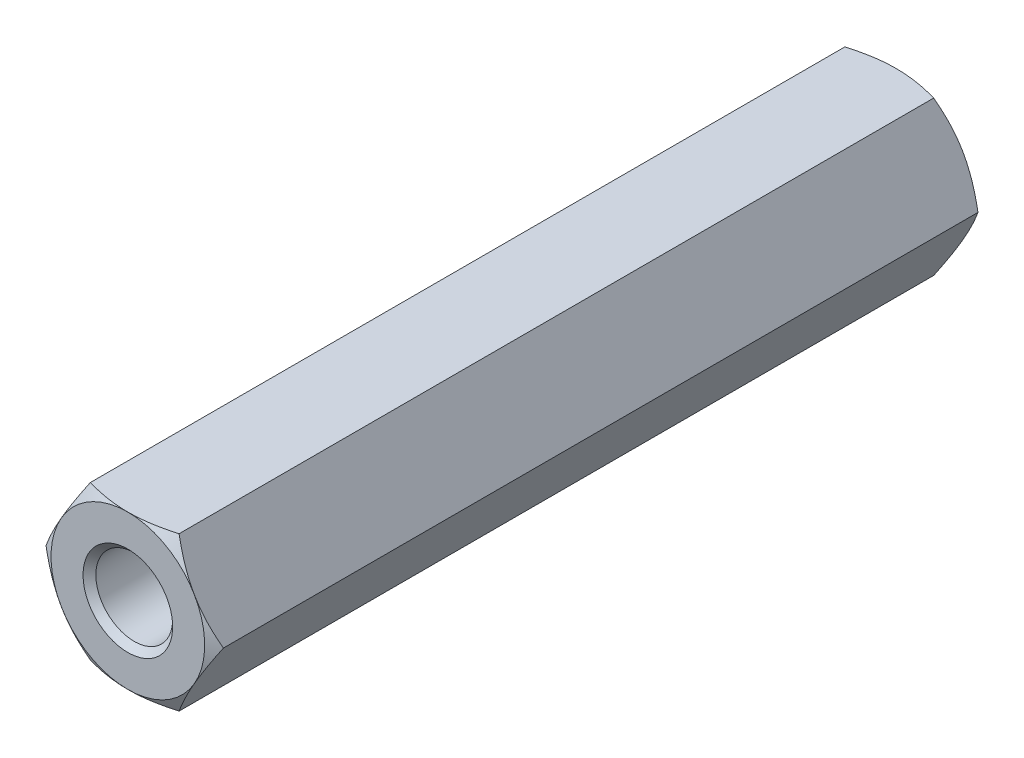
ISO-10303-21;
HEADER;
FILE_DESCRIPTION(('STEP AP214'),'2;1');
FILE_NAME('part.step','',(''),(''),'','','');
FILE_SCHEMA(('AUTOMOTIVE_DESIGN { 1 0 10303 214 1 1 1 1 }'));
ENDSEC;
DATA;
#1=APPLICATION_CONTEXT('core data for automotive mechanical design processes');
#2=APPLICATION_PROTOCOL_DEFINITION('international standard','automotive_design',2000,#1);
#3=PRODUCT_CONTEXT('',#1,'mechanical');
#4=PRODUCT('Part','Part','',(#3));
#5=PRODUCT_RELATED_PRODUCT_CATEGORY('part','',(#4));
#6=PRODUCT_DEFINITION_FORMATION('','',#4);
#7=PRODUCT_DEFINITION_CONTEXT('part definition',#1,'design');
#8=PRODUCT_DEFINITION('design','',#6,#7);
#9=PRODUCT_DEFINITION_SHAPE('','',#8);
#10=(LENGTH_UNIT() NAMED_UNIT(*) SI_UNIT(.MILLI.,.METRE.));
#11=(NAMED_UNIT(*) PLANE_ANGLE_UNIT() SI_UNIT($,.RADIAN.));
#12=(NAMED_UNIT(*) SI_UNIT($,.STERADIAN.) SOLID_ANGLE_UNIT());
#13=UNCERTAINTY_MEASURE_WITH_UNIT(LENGTH_MEASURE(1.E-05),#10,'distance_accuracy_value','');
#14=(GEOMETRIC_REPRESENTATION_CONTEXT(3) GLOBAL_UNCERTAINTY_ASSIGNED_CONTEXT((#13)) GLOBAL_UNIT_ASSIGNED_CONTEXT((#10,
#11,#12)) REPRESENTATION_CONTEXT('',''));
#15=CARTESIAN_POINT('',(0.,0.,0.));
#16=DIRECTION('',(0.,0.,1.));
#17=DIRECTION('',(1.,0.,0.));
#18=AXIS2_PLACEMENT_3D('',#15,#16,#17);
#19=CARTESIAN_POINT('',(3.46410161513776,0.,-15.));
#20=DIRECTION('',(0.866025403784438,0.5,0.));
#21=DIRECTION('',(-0.5,0.866025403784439,0.));
#22=AXIS2_PLACEMENT_3D('',#19,#20,#21);
#23=PLANE('',#22);
#24=CARTESIAN_POINT('',(3.46421708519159,-0.000199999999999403,14.731984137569));
#25=CARTESIAN_POINT('',(3.38810199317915,0.131635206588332,14.7759462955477));
#26=CARTESIAN_POINT('',(3.31132988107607,0.26460840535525,14.8159284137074));
#27=CARTESIAN_POINT('',(3.15645624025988,0.532857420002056,14.8857179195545));
#28=CARTESIAN_POINT('',(3.078351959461,0.668138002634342,14.9155006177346));
#29=CARTESIAN_POINT('',(2.92311136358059,0.937022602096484,14.9618621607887));
#30=CARTESIAN_POINT('',(2.84599893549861,1.07058524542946,14.978749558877));
#31=CARTESIAN_POINT('',(2.6914112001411,1.33833905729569,14.9989103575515));
#32=CARTESIAN_POINT('',(2.61393645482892,1.47252925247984,15.0022004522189));
#33=CARTESIAN_POINT('',(2.46916798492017,1.72327559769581,14.9953594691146));
#34=CARTESIAN_POINT('',(2.40185259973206,1.83986926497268,14.9869080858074));
#35=CARTESIAN_POINT('',(2.2676603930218,2.07229698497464,14.960121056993));
#36=CARTESIAN_POINT('',(2.2007840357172,2.18813023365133,14.9417762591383));
#37=CARTESIAN_POINT('',(2.06631510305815,2.42103725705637,14.8959152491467));
#38=CARTESIAN_POINT('',(1.99873954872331,2.53808155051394,14.8682046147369));
#39=CARTESIAN_POINT('',(1.86459637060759,2.77042435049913,14.8053122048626));
#40=CARTESIAN_POINT('',(1.79802702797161,2.88572583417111,14.7701452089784));
#41=CARTESIAN_POINT('',(1.73193533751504,3.0002,14.731984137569));
#42=B_SPLINE_CURVE_WITH_KNOTS('',3,(#24,#25,#26,#27,#28,#29,#30,#31,#32,#33,#34,#35,#36,#37,#38,
#39,#40,#41),.UNSPECIFIED.,.F.,.F.,(4,2,2,2,2,2,2,2,4),(0.,0.475539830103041,0.952222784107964,
1.41710776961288,1.88142182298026,2.28572436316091,2.69040156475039,3.10405572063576,
3.5168974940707),.UNSPECIFIED.);
#43=CARTESIAN_POINT('',(3.46410161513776,0.,14.7320508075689));
#44=VERTEX_POINT('',#43);
#45=CARTESIAN_POINT('',(2.59807621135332,1.5,15.));
#46=VERTEX_POINT('',#45);
#47=EDGE_CURVE('E171',#44,#46,#42,.T.);
#48=ORIENTED_EDGE('',*,*,#47,.F.);
#49=DIRECTION('',(0.,0.,1.));
#50=VECTOR('',#49,1.);
#51=CARTESIAN_POINT('',(3.46410161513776,0.,-15.));
#52=LINE('',#51,#50);
#53=CARTESIAN_POINT('',(3.46410161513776,0.,-14.7320508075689));
#54=VERTEX_POINT('',#53);
#55=EDGE_CURVE('E320',#54,#44,#52,.T.);
#56=ORIENTED_EDGE('',*,*,#55,.F.);
#57=CARTESIAN_POINT('',(3.46421708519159,-0.000199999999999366,-14.731984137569));
#58=CARTESIAN_POINT('',(3.38810199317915,0.131635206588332,-14.7759462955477));
#59=CARTESIAN_POINT('',(3.31132988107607,0.26460840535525,-14.8159284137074));
#60=CARTESIAN_POINT('',(3.15645624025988,0.532857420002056,-14.8857179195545));
#61=CARTESIAN_POINT('',(3.078351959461,0.668138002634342,-14.9155006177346));
#62=CARTESIAN_POINT('',(2.92311136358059,0.937022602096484,-14.9618621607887));
#63=CARTESIAN_POINT('',(2.84599893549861,1.07058524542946,-14.978749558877));
#64=CARTESIAN_POINT('',(2.6914112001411,1.33833905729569,-14.9989103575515));
#65=CARTESIAN_POINT('',(2.61393645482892,1.47252925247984,-15.0022004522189));
#66=CARTESIAN_POINT('',(2.46916798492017,1.72327559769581,-14.9953594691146));
#67=CARTESIAN_POINT('',(2.40185259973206,1.83986926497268,-14.9869080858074));
#68=CARTESIAN_POINT('',(2.2676603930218,2.07229698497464,-14.960121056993));
#69=CARTESIAN_POINT('',(2.2007840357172,2.18813023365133,-14.9417762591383));
#70=CARTESIAN_POINT('',(2.06631510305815,2.42103725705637,-14.8959152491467));
#71=CARTESIAN_POINT('',(1.99873954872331,2.53808155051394,-14.8682046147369));
#72=CARTESIAN_POINT('',(1.86459637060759,2.77042435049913,-14.8053122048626));
#73=CARTESIAN_POINT('',(1.79802702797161,2.88572583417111,-14.7701452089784));
#74=CARTESIAN_POINT('',(1.73193533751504,3.0002,-14.731984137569));
#75=B_SPLINE_CURVE_WITH_KNOTS('',3,(#57,#58,#59,#60,#61,#62,#63,#64,#65,#66,#67,#68,#69,#70,#71,
#72,#73,#74),.UNSPECIFIED.,.F.,.F.,(4,2,2,2,2,2,2,2,4),(0.,0.475539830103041,0.952222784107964,
1.41710776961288,1.88142182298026,2.28572436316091,2.69040156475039,3.10405572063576,
3.5168974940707),.UNSPECIFIED.);
#76=CARTESIAN_POINT('',(2.59807621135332,1.5,-15.));
#77=VERTEX_POINT('',#76);
#78=EDGE_CURVE('E305',#54,#77,#75,.T.);
#79=ORIENTED_EDGE('',*,*,#78,.T.);
#80=CARTESIAN_POINT('',(1.73205080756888,3.,-14.7320508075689));
#81=VERTEX_POINT('',#80);
#82=EDGE_CURVE('E252',#77,#81,#75,.T.);
#83=ORIENTED_EDGE('',*,*,#82,.T.);
#84=DIRECTION('',(0.,0.,1.));
#85=VECTOR('',#84,1.);
#86=CARTESIAN_POINT('',(1.73205080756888,3.,-15.));
#87=LINE('',#86,#85);
#88=CARTESIAN_POINT('',(1.73205080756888,3.,14.7320508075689));
#89=VERTEX_POINT('',#88);
#90=EDGE_CURVE('E352',#81,#89,#87,.T.);
#91=ORIENTED_EDGE('',*,*,#90,.T.);
#92=EDGE_CURVE('E147',#46,#89,#42,.T.);
#93=ORIENTED_EDGE('',*,*,#92,.F.);
#94=EDGE_LOOP('',(#48,#56,#79,#83,#91,#93));
#95=FACE_BOUND('',#94,.T.);
#96=ADVANCED_FACE('F41',(#95),#23,.T.);
#97=CARTESIAN_POINT('',(1.73205080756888,-3.,-15.));
#98=DIRECTION('',(0.866025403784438,-0.5,0.));
#99=DIRECTION('',(0.5,0.866025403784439,0.));
#100=AXIS2_PLACEMENT_3D('',#97,#98,#99);
#101=PLANE('',#100);
#102=CARTESIAN_POINT('',(1.73193533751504,-3.0002,14.731984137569));
#103=CARTESIAN_POINT('',(1.80805042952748,-2.86836479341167,14.7759462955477));
#104=CARTESIAN_POINT('',(1.88482254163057,-2.73539159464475,14.8159284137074));
#105=CARTESIAN_POINT('',(2.03969618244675,-2.46714257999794,14.8857179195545));
#106=CARTESIAN_POINT('',(2.11780046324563,-2.33186199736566,14.9155006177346));
#107=CARTESIAN_POINT('',(2.27304105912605,-2.06297739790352,14.9618621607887));
#108=CARTESIAN_POINT('',(2.35015348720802,-1.92941475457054,14.9787495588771));
#109=CARTESIAN_POINT('',(2.50474122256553,-1.66166094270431,14.9989103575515));
#110=CARTESIAN_POINT('',(2.58221596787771,-1.52747074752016,15.0022004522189));
#111=CARTESIAN_POINT('',(2.72698443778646,-1.27672440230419,14.9953594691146));
#112=CARTESIAN_POINT('',(2.79429982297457,-1.16013073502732,14.9869080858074));
#113=CARTESIAN_POINT('',(2.92849202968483,-0.927703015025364,14.960121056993));
#114=CARTESIAN_POINT('',(2.99536838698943,-0.81186976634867,14.9417762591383));
#115=CARTESIAN_POINT('',(3.12983731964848,-0.578962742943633,14.8959152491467));
#116=CARTESIAN_POINT('',(3.19741287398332,-0.46191844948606,14.8682046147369));
#117=CARTESIAN_POINT('',(3.33155605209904,-0.229575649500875,14.8053122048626));
#118=CARTESIAN_POINT('',(3.39812539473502,-0.114274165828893,14.7701452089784));
#119=CARTESIAN_POINT('',(3.46421708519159,0.000200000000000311,14.731984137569));
#120=B_SPLINE_CURVE_WITH_KNOTS('',3,(#102,#103,#104,#105,#106,#107,#108,#109,#110,#111,#112,
#113,#114,#115,#116,#117,#118,#119),.UNSPECIFIED.,.F.,.F.,(4,2,2,2,2,2,2,2,4),(0.,
0.47553983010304,0.952222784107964,1.41710776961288,1.88142182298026,2.28572436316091,
2.69040156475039,3.10405572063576,3.5168974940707),.UNSPECIFIED.);
#121=CARTESIAN_POINT('',(1.73205080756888,-3.,14.7320508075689));
#122=VERTEX_POINT('',#121);
#123=CARTESIAN_POINT('',(2.59807621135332,-1.5,15.));
#124=VERTEX_POINT('',#123);
#125=EDGE_CURVE('E421',#122,#124,#120,.T.);
#126=ORIENTED_EDGE('',*,*,#125,.F.);
#127=DIRECTION('',(0.,0.,1.));
#128=VECTOR('',#127,1.);
#129=CARTESIAN_POINT('',(1.73205080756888,-3.,-15.));
#130=LINE('',#129,#128);
#131=CARTESIAN_POINT('',(1.73205080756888,-3.,-14.7320508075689));
#132=VERTEX_POINT('',#131);
#133=EDGE_CURVE('E424',#132,#122,#130,.T.);
#134=ORIENTED_EDGE('',*,*,#133,.F.);
#135=CARTESIAN_POINT('',(1.73193533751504,-3.0002,-14.731984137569));
#136=CARTESIAN_POINT('',(1.80805042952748,-2.86836479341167,-14.7759462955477));
#137=CARTESIAN_POINT('',(1.88482254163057,-2.73539159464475,-14.8159284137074));
#138=CARTESIAN_POINT('',(2.03969618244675,-2.46714257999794,-14.8857179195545));
#139=CARTESIAN_POINT('',(2.11780046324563,-2.33186199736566,-14.9155006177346));
#140=CARTESIAN_POINT('',(2.27304105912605,-2.06297739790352,-14.9618621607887));
#141=CARTESIAN_POINT('',(2.35015348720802,-1.92941475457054,-14.9787495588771));
#142=CARTESIAN_POINT('',(2.50474122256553,-1.66166094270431,-14.9989103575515));
#143=CARTESIAN_POINT('',(2.58221596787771,-1.52747074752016,-15.0022004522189));
#144=CARTESIAN_POINT('',(2.72698443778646,-1.27672440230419,-14.9953594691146));
#145=CARTESIAN_POINT('',(2.79429982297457,-1.16013073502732,-14.9869080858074));
#146=CARTESIAN_POINT('',(2.92849202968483,-0.927703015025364,-14.960121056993));
#147=CARTESIAN_POINT('',(2.99536838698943,-0.81186976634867,-14.9417762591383));
#148=CARTESIAN_POINT('',(3.12983731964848,-0.578962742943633,-14.8959152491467));
#149=CARTESIAN_POINT('',(3.19741287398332,-0.46191844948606,-14.8682046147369));
#150=CARTESIAN_POINT('',(3.33155605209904,-0.229575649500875,-14.8053122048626));
#151=CARTESIAN_POINT('',(3.39812539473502,-0.114274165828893,-14.7701452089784));
#152=CARTESIAN_POINT('',(3.46421708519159,0.000200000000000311,-14.731984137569));
#153=B_SPLINE_CURVE_WITH_KNOTS('',3,(#135,#136,#137,#138,#139,#140,#141,#142,#143,#144,#145,
#146,#147,#148,#149,#150,#151,#152),.UNSPECIFIED.,.F.,.F.,(4,2,2,2,2,2,2,2,4),(0.,
0.47553983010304,0.952222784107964,1.41710776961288,1.88142182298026,2.28572436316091,
2.69040156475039,3.10405572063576,3.5168974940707),.UNSPECIFIED.);
#154=CARTESIAN_POINT('',(2.59807621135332,-1.5,-15.));
#155=VERTEX_POINT('',#154);
#156=EDGE_CURVE('E335',#132,#155,#153,.T.);
#157=ORIENTED_EDGE('',*,*,#156,.T.);
#158=EDGE_CURVE('E249',#155,#54,#153,.T.);
#159=ORIENTED_EDGE('',*,*,#158,.T.);
#160=ORIENTED_EDGE('',*,*,#55,.T.);
#161=EDGE_CURVE('E175',#124,#44,#120,.T.);
#162=ORIENTED_EDGE('',*,*,#161,.F.);
#163=EDGE_LOOP('',(#126,#134,#157,#159,#160,#162));
#164=FACE_BOUND('',#163,.T.);
#165=ADVANCED_FACE('F332',(#164),#101,.T.);
#166=CARTESIAN_POINT('',(-1.73205080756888,-3.,-15.));
#167=DIRECTION('',(0.,-1.,0.));
#168=DIRECTION('',(0.,0.,-1.));
#169=AXIS2_PLACEMENT_3D('',#166,#167,#168);
#170=PLANE('',#169);
#171=CARTESIAN_POINT('',(-23.5121203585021,-3.,3.04726845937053));
#172=CARTESIAN_POINT('',(-23.0125016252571,-3.,3.33340131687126));
#173=CARTESIAN_POINT('',(-22.5128220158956,-3.,3.61942793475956));
#174=CARTESIAN_POINT('',(-21.5133088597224,-3.,4.19121257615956));
#175=CARTESIAN_POINT('',(-21.0134753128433,-3.,4.47697059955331));
#176=CARTESIAN_POINT('',(-19.5136614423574,-3.,5.33377705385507));
#177=CARTESIAN_POINT('',(-18.5134025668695,-3.,5.90433799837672));
#178=CARTESIAN_POINT('',(-16.5093485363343,-3.,7.04478460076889));
#179=CARTESIAN_POINT('',(-15.505550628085,-3.,7.61466542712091));
#180=CARTESIAN_POINT('',(-13.9983454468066,-3.,8.46679124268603));
#181=CARTESIAN_POINT('',(-13.4956984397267,-3.,8.75038052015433));
#182=CARTESIAN_POINT('',(-12.489700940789,-3.,9.31630809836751));
#183=CARTESIAN_POINT('',(-11.9863504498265,-3.,9.59864640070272));
#184=CARTESIAN_POINT('',(-10.978614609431,-3.,10.1615674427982));
#185=CARTESIAN_POINT('',(-10.4742291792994,-3.,10.4421500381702));
#186=CARTESIAN_POINT('',(-9.46397256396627,-3.,11.0006941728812));
#187=CARTESIAN_POINT('',(-8.9581013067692,-3.,11.2786555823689));
#188=CARTESIAN_POINT('',(-8.19786328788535,-3.,11.6922788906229));
#189=CARTESIAN_POINT('',(-7.94435759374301,-3.,11.8295225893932));
#190=CARTESIAN_POINT('',(-7.43660558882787,-3.,12.1026322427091));
#191=CARTESIAN_POINT('',(-7.18235928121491,-3.,12.2384982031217));
#192=CARTESIAN_POINT('',(-6.67292612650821,-3.,12.5083994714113));
#193=CARTESIAN_POINT('',(-6.41773937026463,-3.,12.6424349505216));
#194=CARTESIAN_POINT('',(-5.90608526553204,-3.,12.9080359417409));
#195=CARTESIAN_POINT('',(-5.64961793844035,-3.,13.0396014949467));
#196=CARTESIAN_POINT('',(-5.13550344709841,-3.,13.2989862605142));
#197=CARTESIAN_POINT('',(-4.87786014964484,-3.,13.4268131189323));
#198=CARTESIAN_POINT('',(-4.36009697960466,-3.,13.6775229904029));
#199=CARTESIAN_POINT('',(-4.09997665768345,-3.,13.8004050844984));
#200=CARTESIAN_POINT('',(-3.70668295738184,-3.,13.9792931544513));
#201=CARTESIAN_POINT('',(-3.57479856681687,-3.,14.0381291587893));
#202=CARTESIAN_POINT('',(-3.30998465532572,-3.,14.1533943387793));
#203=CARTESIAN_POINT('',(-3.17705517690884,-3.,14.209823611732));
#204=CARTESIAN_POINT('',(-2.90996739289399,-3.,14.3196438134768));
#205=CARTESIAN_POINT('',(-2.77580930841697,-3.,14.3730352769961));
#206=CARTESIAN_POINT('',(-2.50602641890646,-3.,14.4759538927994));
#207=CARTESIAN_POINT('',(-2.3704017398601,-3.,14.5254813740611));
#208=CARTESIAN_POINT('',(-2.0616346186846,-3.,14.6319545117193));
#209=CARTESIAN_POINT('',(-1.88797956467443,-3.,14.6874399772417));
#210=CARTESIAN_POINT('',(-1.53756772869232,-3.,14.7877447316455));
#211=CARTESIAN_POINT('',(-1.36081106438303,-3.,14.8325644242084));
#212=CARTESIAN_POINT('',(-1.00613235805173,-3.,14.907631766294));
#213=CARTESIAN_POINT('',(-0.828244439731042,-3.,14.9380340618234));
#214=CARTESIAN_POINT('',(-0.55989242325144,-3.,14.9708201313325));
#215=CARTESIAN_POINT('',(-0.470192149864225,-3.,14.9796124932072));
#216=CARTESIAN_POINT('',(-0.290467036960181,-3.,14.9926604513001));
#217=CARTESIAN_POINT('',(-0.200442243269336,-3.,14.9969166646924));
#218=CARTESIAN_POINT('',(-0.0194561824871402,-3.,15.0007576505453));
#219=CARTESIAN_POINT('',(0.071506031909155,-3.,15.0002987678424));
#220=CARTESIAN_POINT('',(0.25327359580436,-3.,14.9946299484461));
#221=CARTESIAN_POINT('',(0.344078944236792,-3.,14.9894199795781));
#222=CARTESIAN_POINT('',(0.615961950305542,-3.,14.9668925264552));
#223=CARTESIAN_POINT('',(0.796507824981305,-3.,14.9426775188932));
#224=CARTESIAN_POINT('',(1.06617280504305,-3.,14.8945500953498));
#225=CARTESIAN_POINT('',(1.15640234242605,-3.,14.8763960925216));
#226=CARTESIAN_POINT('',(1.3360958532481,-3.,14.8365924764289));
#227=CARTESIAN_POINT('',(1.42555981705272,-3.,14.814942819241));
#228=CARTESIAN_POINT('',(1.60369363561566,-3.,14.768592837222));
#229=CARTESIAN_POINT('',(1.69236342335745,-3.,14.7438922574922));
#230=CARTESIAN_POINT('',(1.86891903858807,-3.,14.6918626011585));
#231=CARTESIAN_POINT('',(1.95680490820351,-3.,14.6645336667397));
#232=CARTESIAN_POINT('',(2.21653910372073,-3.,14.5800952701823));
#233=CARTESIAN_POINT('',(2.38733895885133,-3.,14.5197588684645));
#234=CARTESIAN_POINT('',(2.72656600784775,-3.,14.3927121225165));
#235=CARTESIAN_POINT('',(2.89499251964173,-3.,14.3259999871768));
#236=CARTESIAN_POINT('',(3.23005689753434,-3.,14.1878076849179));
#237=CARTESIAN_POINT('',(3.39669288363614,-3.,14.1163229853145));
#238=CARTESIAN_POINT('',(3.72838320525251,-3.,13.9698388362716));
#239=CARTESIAN_POINT('',(3.89343770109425,-3.,13.8948397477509));
#240=CARTESIAN_POINT('',(4.22275500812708,-3.,13.7419530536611));
#241=CARTESIAN_POINT('',(4.38701436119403,-3.,13.6640580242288));
#242=CARTESIAN_POINT('',(4.71452905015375,-3.,13.5061817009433));
#243=CARTESIAN_POINT('',(4.87778436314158,-3.,13.426200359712));
#244=CARTESIAN_POINT('',(5.36616370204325,-3.,13.1839158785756));
#245=CARTESIAN_POINT('',(5.69008278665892,-3.,13.019186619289));
#246=CARTESIAN_POINT('',(6.33711013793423,-3.,12.6849027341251));
#247=CARTESIAN_POINT('',(6.66020946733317,-3.,12.5153309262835));
#248=CARTESIAN_POINT('',(7.30493962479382,-3.,12.1733240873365));
#249=CARTESIAN_POINT('',(7.62657026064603,-3.,12.0008886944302));
#250=CARTESIAN_POINT('',(8.26818113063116,-3.,11.654320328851));
#251=CARTESIAN_POINT('',(8.58816327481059,-3.,11.4801908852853));
#252=CARTESIAN_POINT('',(9.22732690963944,-3.,11.1304674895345));
#253=CARTESIAN_POINT('',(9.54650839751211,-3.,10.9548735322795));
#254=CARTESIAN_POINT('',(10.442065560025,-3.,10.4601995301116));
#255=CARTESIAN_POINT('',(11.0177581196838,-3.,10.1398834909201));
#256=CARTESIAN_POINT('',(12.167901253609,-3.,9.49701304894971));
#257=CARTESIAN_POINT('',(12.7423518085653,-3.,9.17445861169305));
#258=CARTESIAN_POINT('',(13.8907915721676,-3.,8.52761768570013));
#259=CARTESIAN_POINT('',(14.4647802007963,-3.,8.20333016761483));
#260=CARTESIAN_POINT('',(15.6121551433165,-3.,7.55369151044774));
#261=CARTESIAN_POINT('',(16.1855414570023,-3.,7.22834037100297));
#262=CARTESIAN_POINT('',(17.3223106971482,-3.,6.58229545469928));
#263=CARTESIAN_POINT('',(17.8857009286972,-3.,6.26161452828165));
#264=CARTESIAN_POINT('',(19.0121589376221,-3.,5.61968480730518));
#265=CARTESIAN_POINT('',(19.5752267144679,-3.,5.29843601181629));
#266=CARTESIAN_POINT('',(20.7007116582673,-3.,4.65573003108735));
#267=CARTESIAN_POINT('',(21.263129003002,-3.,4.33427315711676));
#268=CARTESIAN_POINT('',(22.3877627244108,-3.,3.6910106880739));
#269=CARTESIAN_POINT('',(22.9499791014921,-3.,3.36920509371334));
#270=CARTESIAN_POINT('',(23.5121203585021,-3.,3.04726845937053));
#271=B_SPLINE_CURVE_WITH_KNOTS('',3,(#171,#172,#173,#174,#175,#176,#177,#178,#179,#180,#181,
#182,#183,#184,#185,#186,#187,#188,#189,#190,#191,#192,#193,#194,#195,#196,#197,#198,#199,#200,
#201,#202,#203,#204,#205,#206,#207,#208,#209,#210,#211,#212,#213,#214,#215,#216,#217,#218,#219,
#220,#221,#222,#223,#224,#225,#226,#227,#228,#229,#230,#231,#232,#233,#234,#235,#236,#237,#238,
#239,#240,#241,#242,#243,#244,#245,#246,#247,#248,#249,#250,#251,#252,#253,#254,#255,#256,#257,
#258,#259,#260,#261,#262,#263,#264,#265,#266,#267,#268,#269,#270),.UNSPECIFIED.,.F.,.F.,(4,2,2,
2,2,2,2,2,2,2,2,2,2,2,2,2,2,2,2,2,2,2,2,2,2,2,2,2,2,2,2,2,2,2,2,2,2,2,2,2,2,2,2,2,2,2,2,2,2,4),
(0.,1.72725739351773,3.45451554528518,6.90915175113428,10.3720022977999,12.1033855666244,
13.8347666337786,15.5662882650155,17.2978952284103,18.162709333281,19.0275197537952,
19.8922487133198,20.7569632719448,21.6197642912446,22.4827249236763,22.9159462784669,
23.3491501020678,23.7822774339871,24.2153678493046,24.7620210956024,25.3086536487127,
25.8492822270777,26.1195740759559,26.3898291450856,26.6625886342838,26.9353499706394,
27.4808688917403,27.7569347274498,28.0330040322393,28.3090964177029,28.5851738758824,
29.1284076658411,29.6717945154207,30.2157049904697,30.7595597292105,31.3049205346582,
31.850293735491,32.9404377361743,34.0351038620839,35.1299093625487,36.222784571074,
37.3156635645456,39.292069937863,41.2685068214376,43.2462887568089,45.2240713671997,
47.1688596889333,49.1136511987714,51.0570578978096,53.0004606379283),.UNSPECIFIED.);
#272=CARTESIAN_POINT('',(-1.73205080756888,-3.,14.7320508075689));
#273=VERTEX_POINT('',#272);
#274=CARTESIAN_POINT('',(0.,-3.,15.));
#275=VERTEX_POINT('',#274);
#276=EDGE_CURVE('E416',#273,#275,#271,.T.);
#277=ORIENTED_EDGE('',*,*,#276,.F.);
#278=DIRECTION('',(0.,0.,1.));
#279=VECTOR('',#278,1.);
#280=CARTESIAN_POINT('',(-1.73205080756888,-3.,-15.));
#281=LINE('',#280,#279);
#282=CARTESIAN_POINT('',(-1.73205080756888,-3.,-14.7320508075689));
#283=VERTEX_POINT('',#282);
#284=EDGE_CURVE('E426',#283,#273,#281,.T.);
#285=ORIENTED_EDGE('',*,*,#284,.F.);
#286=CARTESIAN_POINT('',(-13.3581553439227,-3.,-8.82761504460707));
#287=CARTESIAN_POINT('',(-13.0674077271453,-3.,-8.99139273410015));
#288=CARTESIAN_POINT('',(-12.7765550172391,-3.,-9.15498426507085));
#289=CARTESIAN_POINT('',(-12.1945812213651,-3.,-9.48169180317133));
#290=CARTESIAN_POINT('',(-11.9034601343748,-3.,-9.64480780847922));
#291=CARTESIAN_POINT('',(-11.3208342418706,-3.,-9.97049302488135));
#292=CARTESIAN_POINT('',(-11.0293293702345,-3.,-10.1330621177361));
#293=CARTESIAN_POINT('',(-10.4459156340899,-3.,-10.457472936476));
#294=CARTESIAN_POINT('',(-10.1540067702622,-3.,-10.6193146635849));
#295=CARTESIAN_POINT('',(-9.57133373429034,-3.,-10.9411592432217));
#296=CARTESIAN_POINT('',(-9.28057244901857,-3.,-11.1011673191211));
#297=CARTESIAN_POINT('',(-8.69840129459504,-3.,-11.4199990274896));
#298=CARTESIAN_POINT('',(-8.40699142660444,-3.,-11.5788226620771));
#299=CARTESIAN_POINT('',(-7.82335384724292,-3.,-11.894881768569));
#300=CARTESIAN_POINT('',(-7.53112623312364,-3.,-12.0521174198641));
#301=CARTESIAN_POINT('',(-6.94553147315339,-3.,-12.3644501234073));
#302=CARTESIAN_POINT('',(-6.65216433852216,-3.,-12.5195471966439));
#303=CARTESIAN_POINT('',(-6.05641927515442,-3.,-12.8306140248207));
#304=CARTESIAN_POINT('',(-5.75400103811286,-3.,-12.9865067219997));
#305=CARTESIAN_POINT('',(-5.14673632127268,-3.,-13.2936759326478));
#306=CARTESIAN_POINT('',(-4.84188938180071,-3.,-13.4449515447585));
#307=CARTESIAN_POINT('',(-4.38096115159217,-3.,-13.6668878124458));
#308=CARTESIAN_POINT('',(-4.22619248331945,-3.,-13.7402706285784));
#309=CARTESIAN_POINT('',(-3.91555008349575,-3.,-13.8846537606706));
#310=CARTESIAN_POINT('',(-3.75967638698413,-3.,-13.9556541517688));
#311=CARTESIAN_POINT('',(-3.44659458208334,-3.,-14.0945658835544));
#312=CARTESIAN_POINT('',(-3.28938678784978,-3.,-14.1624779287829));
#313=CARTESIAN_POINT('',(-2.97329285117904,-3.,-14.2942572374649));
#314=CARTESIAN_POINT('',(-2.81440685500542,-3.,-14.3581248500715));
#315=CARTESIAN_POINT('',(-2.47241677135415,-3.,-14.4889712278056));
#316=CARTESIAN_POINT('',(-2.28900492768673,-3.,-14.5551567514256));
#317=CARTESIAN_POINT('',(-1.91889634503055,-3.,-14.6778522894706));
#318=CARTESIAN_POINT('',(-1.73219914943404,-3.,-14.7343609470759));
#319=CARTESIAN_POINT('',(-1.35757107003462,-3.,-14.8333033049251));
#320=CARTESIAN_POINT('',(-1.16968774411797,-3.,-14.8759103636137));
#321=CARTESIAN_POINT('',(-0.885576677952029,-3.,-14.9268606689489));
#322=CARTESIAN_POINT('',(-0.790500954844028,-3.,-14.9416832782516));
#323=CARTESIAN_POINT('',(-0.599732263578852,-3.,-14.9665429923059));
#324=CARTESIAN_POINT('',(-0.504039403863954,-3.,-14.9765809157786));
#325=CARTESIAN_POINT('',(-0.310465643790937,-3.,-14.9916462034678));
#326=CARTESIAN_POINT('',(-0.21257713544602,-3.,-14.9965769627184));
#327=CARTESIAN_POINT('',(-0.0166774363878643,-3.,-15.000895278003));
#328=CARTESIAN_POINT('',(0.0813337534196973,-3.,-15.00028287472));
#329=CARTESIAN_POINT('',(0.277172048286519,-3.,-14.9935389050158));
#330=CARTESIAN_POINT('',(0.374999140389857,-3.,-14.987406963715));
#331=CARTESIAN_POINT('',(0.570170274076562,-3.,-14.9698753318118));
#332=CARTESIAN_POINT('',(0.667514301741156,-3.,-14.9584754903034));
#333=CARTESIAN_POINT('',(0.960876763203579,-3.,-14.9166405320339));
#334=CARTESIAN_POINT('',(1.15584956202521,-3.,-14.8786675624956));
#335=CARTESIAN_POINT('',(1.44544526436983,-3.,-14.8101154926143));
#336=CARTESIAN_POINT('',(1.54153346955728,-3.,-14.7853218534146));
#337=CARTESIAN_POINT('',(1.73279599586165,-3.,-14.7324213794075));
#338=CARTESIAN_POINT('',(1.8279703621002,-3.,-14.7043147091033));
#339=CARTESIAN_POINT('',(2.08350367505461,-3.,-14.624713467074));
#340=CARTESIAN_POINT('',(2.2430363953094,-3.,-14.5705774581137));
#341=CARTESIAN_POINT('',(2.55992784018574,-3.,-14.4562402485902));
#342=CARTESIAN_POINT('',(2.71728599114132,-3.,-14.3960374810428));
#343=CARTESIAN_POINT('',(3.03032027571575,-3.,-14.2710172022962));
#344=CARTESIAN_POINT('',(3.18599466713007,-3.,-14.2061953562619));
#345=CARTESIAN_POINT('',(3.49583273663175,-3.,-14.0730945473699));
#346=CARTESIAN_POINT('',(3.64999655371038,-3.,-14.0048159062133));
#347=CARTESIAN_POINT('',(3.95751153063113,-3.,-13.8654146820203));
#348=CARTESIAN_POINT('',(4.11085953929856,-3.,-13.7942851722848));
#349=CARTESIAN_POINT('',(4.41656841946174,-3.,-13.6499319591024));
#350=CARTESIAN_POINT('',(4.56892926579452,-3.,-13.5767082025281));
#351=CARTESIAN_POINT('',(5.02464616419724,-3.,-13.3546584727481));
#352=CARTESIAN_POINT('',(5.32680431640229,-3.,-13.2033767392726));
#353=CARTESIAN_POINT('',(5.93014146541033,-3.,-12.8959703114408));
#354=CARTESIAN_POINT('',(6.23131182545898,-3.,-12.7398287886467));
#355=CARTESIAN_POINT('',(6.83214794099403,-3.,-12.4245944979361));
#356=CARTESIAN_POINT('',(7.13181350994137,-3.,-12.2655013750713));
#357=CARTESIAN_POINT('',(7.72956256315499,-3.,-11.9454836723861));
#358=CARTESIAN_POINT('',(8.02764778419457,-3.,-11.7845623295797));
#359=CARTESIAN_POINT('',(8.62299007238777,-3.,-11.4611940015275));
#360=CARTESIAN_POINT('',(8.92024713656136,-3.,-11.298747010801));
#361=CARTESIAN_POINT('',(9.56466312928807,-3.,-10.9449615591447));
#362=CARTESIAN_POINT('',(9.91170551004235,-3.,-10.7534109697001));
#363=CARTESIAN_POINT('',(10.6052826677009,-3.,-10.3690699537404));
#364=CARTESIAN_POINT('',(10.9518171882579,-3.,-10.1762790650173));
#365=CARTESIAN_POINT('',(11.6419356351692,-3.,-9.79118510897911));
#366=CARTESIAN_POINT('',(11.9855230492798,-3.,-9.59888828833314));
#367=CARTESIAN_POINT('',(12.6721730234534,-3.,-9.21368353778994));
#368=CARTESIAN_POINT('',(13.0152357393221,-3.,-9.02077588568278));
#369=CARTESIAN_POINT('',(13.3581553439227,-3.,-8.82761504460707));
#370=B_SPLINE_CURVE_WITH_KNOTS('',3,(#286,#287,#288,#289,#290,#291,#292,#293,#294,#295,#296,
#297,#298,#299,#300,#301,#302,#303,#304,#305,#306,#307,#308,#309,#310,#311,#312,#313,#314,#315,
#316,#317,#318,#319,#320,#321,#322,#323,#324,#325,#326,#327,#328,#329,#330,#331,#332,#333,#334,
#335,#336,#337,#338,#339,#340,#341,#342,#343,#344,#345,#346,#347,#348,#349,#350,#351,#352,#353,
#354,#355,#356,#357,#358,#359,#360,#361,#362,#363,#364,#365,#366,#367,#368,#369),.UNSPECIFIED.,
.F.,.F.,(4,2,2,2,2,2,2,2,2,2,2,2,2,2,2,2,2,2,2,2,2,2,2,2,2,2,2,2,2,2,2,2,2,2,2,2,2,2,2,2,2,4),
(0.,1.00110750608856,2.00221884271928,3.00353425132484,4.00484797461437,5.00048761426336,
5.99612547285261,6.99164956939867,7.98716388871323,9.00784480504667,10.0287237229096,
10.5425621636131,11.0563843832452,11.5700887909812,12.0837487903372,12.6685158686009,
13.2533648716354,13.8306139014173,14.1191845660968,14.4077058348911,14.7015901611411,
14.9954723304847,15.289374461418,15.5832850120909,16.1782055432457,16.4758769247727,
16.773533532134,17.2787595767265,17.7841164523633,18.2899539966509,18.7957445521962,
19.3028489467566,19.8099662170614,20.8236468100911,21.8413478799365,22.8591721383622,
23.8754117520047,24.8916550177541,26.0808409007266,27.2704990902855,28.451715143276,
29.6324547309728),.UNSPECIFIED.);
#371=CARTESIAN_POINT('',(0.,-3.,-15.));
#372=VERTEX_POINT('',#371);
#373=EDGE_CURVE('E346',#283,#372,#370,.T.);
#374=ORIENTED_EDGE('',*,*,#373,.T.);
#375=EDGE_CURVE('E277',#372,#132,#370,.T.);
#376=ORIENTED_EDGE('',*,*,#375,.T.);
#377=ORIENTED_EDGE('',*,*,#133,.T.);
#378=EDGE_CURVE('E211',#275,#122,#271,.T.);
#379=ORIENTED_EDGE('',*,*,#378,.F.);
#380=EDGE_LOOP('',(#277,#285,#374,#376,#377,#379));
#381=FACE_BOUND('',#380,.T.);
#382=ADVANCED_FACE('F234',(#381),#170,.T.);
#383=CARTESIAN_POINT('',(-3.46410161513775,0.,-15.));
#384=DIRECTION('',(-0.866025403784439,-0.5,0.));
#385=DIRECTION('',(0.5,-0.866025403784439,0.));
#386=AXIS2_PLACEMENT_3D('',#383,#384,#385);
#387=PLANE('',#386);
#388=CARTESIAN_POINT('',(-3.46421708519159,0.000200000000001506,14.731984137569));
#389=CARTESIAN_POINT('',(-3.38810199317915,-0.13163520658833,14.7759462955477));
#390=CARTESIAN_POINT('',(-3.31132988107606,-0.264608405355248,14.8159284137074));
#391=CARTESIAN_POINT('',(-3.15645624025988,-0.532857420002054,14.8857179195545));
#392=CARTESIAN_POINT('',(-3.078351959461,-0.66813800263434,14.9155006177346));
#393=CARTESIAN_POINT('',(-2.92311136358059,-0.937022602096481,14.9618621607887));
#394=CARTESIAN_POINT('',(-2.84599893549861,-1.07058524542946,14.9787495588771));
#395=CARTESIAN_POINT('',(-2.6914112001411,-1.33833905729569,14.9989103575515));
#396=CARTESIAN_POINT('',(-2.61393645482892,-1.47252925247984,15.0022004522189));
#397=CARTESIAN_POINT('',(-2.46916798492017,-1.72327559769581,14.9953594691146));
#398=CARTESIAN_POINT('',(-2.40185259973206,-1.83986926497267,14.9869080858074));
#399=CARTESIAN_POINT('',(-2.2676603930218,-2.07229698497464,14.960121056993));
#400=CARTESIAN_POINT('',(-2.2007840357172,-2.18813023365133,14.9417762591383));
#401=CARTESIAN_POINT('',(-2.06631510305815,-2.42103725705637,14.8959152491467));
#402=CARTESIAN_POINT('',(-1.99873954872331,-2.53808155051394,14.8682046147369));
#403=CARTESIAN_POINT('',(-1.86459637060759,-2.77042435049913,14.8053122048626));
#404=CARTESIAN_POINT('',(-1.79802702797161,-2.88572583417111,14.7701452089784));
#405=CARTESIAN_POINT('',(-1.73193533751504,-3.0002,14.731984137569));
#406=B_SPLINE_CURVE_WITH_KNOTS('',3,(#388,#389,#390,#391,#392,#393,#394,#395,#396,#397,#398,
#399,#400,#401,#402,#403,#404,#405),.UNSPECIFIED.,.F.,.F.,(4,2,2,2,2,2,2,2,4),(0.,
0.475539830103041,0.952222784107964,1.41710776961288,1.88142182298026,2.28572436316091,
2.69040156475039,3.10405572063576,3.5168974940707),.UNSPECIFIED.);
#407=CARTESIAN_POINT('',(-3.46410161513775,0.,14.7320508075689));
#408=VERTEX_POINT('',#407);
#409=CARTESIAN_POINT('',(-2.59807621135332,-1.5,15.));
#410=VERTEX_POINT('',#409);
#411=EDGE_CURVE('E156',#408,#410,#406,.T.);
#412=ORIENTED_EDGE('',*,*,#411,.F.);
#413=DIRECTION('',(0.,0.,1.));
#414=VECTOR('',#413,1.);
#415=CARTESIAN_POINT('',(-3.46410161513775,0.,-15.));
#416=LINE('',#415,#414);
#417=CARTESIAN_POINT('',(-3.46410161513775,0.,-14.7320508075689));
#418=VERTEX_POINT('',#417);
#419=EDGE_CURVE('E169',#418,#408,#416,.T.);
#420=ORIENTED_EDGE('',*,*,#419,.F.);
#421=CARTESIAN_POINT('',(-3.46421708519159,0.000200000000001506,-14.731984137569));
#422=CARTESIAN_POINT('',(-3.38810199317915,-0.13163520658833,-14.7759462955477));
#423=CARTESIAN_POINT('',(-3.31132988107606,-0.264608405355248,-14.8159284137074));
#424=CARTESIAN_POINT('',(-3.15645624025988,-0.532857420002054,-14.8857179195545));
#425=CARTESIAN_POINT('',(-3.078351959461,-0.66813800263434,-14.9155006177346));
#426=CARTESIAN_POINT('',(-2.92311136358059,-0.937022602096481,-14.9618621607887));
#427=CARTESIAN_POINT('',(-2.84599893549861,-1.07058524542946,-14.9787495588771));
#428=CARTESIAN_POINT('',(-2.6914112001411,-1.33833905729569,-14.9989103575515));
#429=CARTESIAN_POINT('',(-2.61393645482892,-1.47252925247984,-15.0022004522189));
#430=CARTESIAN_POINT('',(-2.46916798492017,-1.72327559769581,-14.9953594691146));
#431=CARTESIAN_POINT('',(-2.40185259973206,-1.83986926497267,-14.9869080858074));
#432=CARTESIAN_POINT('',(-2.2676603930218,-2.07229698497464,-14.960121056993));
#433=CARTESIAN_POINT('',(-2.2007840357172,-2.18813023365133,-14.9417762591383));
#434=CARTESIAN_POINT('',(-2.06631510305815,-2.42103725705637,-14.8959152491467));
#435=CARTESIAN_POINT('',(-1.99873954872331,-2.53808155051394,-14.8682046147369));
#436=CARTESIAN_POINT('',(-1.86459637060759,-2.77042435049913,-14.8053122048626));
#437=CARTESIAN_POINT('',(-1.79802702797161,-2.88572583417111,-14.7701452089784));
#438=CARTESIAN_POINT('',(-1.73193533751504,-3.0002,-14.731984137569));
#439=B_SPLINE_CURVE_WITH_KNOTS('',3,(#421,#422,#423,#424,#425,#426,#427,#428,#429,#430,#431,
#432,#433,#434,#435,#436,#437,#438),.UNSPECIFIED.,.F.,.F.,(4,2,2,2,2,2,2,2,4),(0.,
0.475539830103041,0.952222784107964,1.41710776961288,1.88142182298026,2.28572436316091,
2.69040156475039,3.10405572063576,3.5168974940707),.UNSPECIFIED.);
#440=CARTESIAN_POINT('',(-2.59807621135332,-1.5,-15.));
#441=VERTEX_POINT('',#440);
#442=EDGE_CURVE('E239',#418,#441,#439,.T.);
#443=ORIENTED_EDGE('',*,*,#442,.T.);
#444=EDGE_CURVE('E251',#441,#283,#439,.T.);
#445=ORIENTED_EDGE('',*,*,#444,.T.);
#446=ORIENTED_EDGE('',*,*,#284,.T.);
#447=EDGE_CURVE('E177',#410,#273,#406,.T.);
#448=ORIENTED_EDGE('',*,*,#447,.F.);
#449=EDGE_LOOP('',(#412,#420,#443,#445,#446,#448));
#450=FACE_BOUND('',#449,.T.);
#451=ADVANCED_FACE('F231',(#450),#387,.T.);
#452=CARTESIAN_POINT('',(-1.73205080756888,3.,-15.));
#453=DIRECTION('',(-0.866025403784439,0.5,0.));
#454=DIRECTION('',(-0.5,-0.866025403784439,0.));
#455=AXIS2_PLACEMENT_3D('',#452,#453,#454);
#456=PLANE('',#455);
#457=CARTESIAN_POINT('',(-1.73193533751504,3.0002,14.731984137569));
#458=CARTESIAN_POINT('',(-1.80805042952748,2.86836479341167,14.7759462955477));
#459=CARTESIAN_POINT('',(-1.88482254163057,2.73539159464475,14.8159284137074));
#460=CARTESIAN_POINT('',(-2.03969618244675,2.46714257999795,14.8857179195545));
#461=CARTESIAN_POINT('',(-2.11780046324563,2.33186199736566,14.9155006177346));
#462=CARTESIAN_POINT('',(-2.27304105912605,2.06297739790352,14.9618621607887));
#463=CARTESIAN_POINT('',(-2.35015348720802,1.92941475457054,14.9787495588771));
#464=CARTESIAN_POINT('',(-2.50474122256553,1.66166094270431,14.9989103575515));
#465=CARTESIAN_POINT('',(-2.58221596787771,1.52747074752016,15.0022004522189));
#466=CARTESIAN_POINT('',(-2.72698443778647,1.27672440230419,14.9953594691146));
#467=CARTESIAN_POINT('',(-2.79429982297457,1.16013073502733,14.9869080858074));
#468=CARTESIAN_POINT('',(-2.92849202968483,0.927703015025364,14.960121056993));
#469=CARTESIAN_POINT('',(-2.99536838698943,0.811869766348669,14.9417762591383));
#470=CARTESIAN_POINT('',(-3.12983731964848,0.578962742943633,14.8959152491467));
#471=CARTESIAN_POINT('',(-3.19741287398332,0.46191844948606,14.8682046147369));
#472=CARTESIAN_POINT('',(-3.33155605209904,0.229575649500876,14.8053122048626));
#473=CARTESIAN_POINT('',(-3.39812539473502,0.114274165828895,14.7701452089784));
#474=CARTESIAN_POINT('',(-3.46421708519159,-0.000199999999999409,14.731984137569));
#475=B_SPLINE_CURVE_WITH_KNOTS('',3,(#457,#458,#459,#460,#461,#462,#463,#464,#465,#466,#467,
#468,#469,#470,#471,#472,#473,#474),.UNSPECIFIED.,.F.,.F.,(4,2,2,2,2,2,2,2,4),(0.,
0.475539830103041,0.952222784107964,1.41710776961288,1.88142182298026,2.28572436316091,
2.69040156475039,3.10405572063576,3.5168974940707),.UNSPECIFIED.);
#476=CARTESIAN_POINT('',(-1.73205080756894,3.,14.7320508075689));
#477=VERTEX_POINT('',#476);
#478=CARTESIAN_POINT('',(-2.59807621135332,1.5,15.));
#479=VERTEX_POINT('',#478);
#480=EDGE_CURVE('E135',#477,#479,#475,.T.);
#481=ORIENTED_EDGE('',*,*,#480,.F.);
#482=DIRECTION('',(0.,0.,1.));
#483=VECTOR('',#482,1.);
#484=CARTESIAN_POINT('',(-1.73205080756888,3.,-15.));
#485=LINE('',#484,#483);
#486=CARTESIAN_POINT('',(-1.73205080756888,3.,-14.7320508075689));
#487=VERTEX_POINT('',#486);
#488=EDGE_CURVE('E355',#487,#477,#485,.T.);
#489=ORIENTED_EDGE('',*,*,#488,.F.);
#490=CARTESIAN_POINT('',(-1.73193533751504,3.0002,-14.731984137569));
#491=CARTESIAN_POINT('',(-1.80805042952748,2.86836479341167,-14.7759462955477));
#492=CARTESIAN_POINT('',(-1.88482254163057,2.73539159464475,-14.8159284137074));
#493=CARTESIAN_POINT('',(-2.03969618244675,2.46714257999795,-14.8857179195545));
#494=CARTESIAN_POINT('',(-2.11780046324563,2.33186199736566,-14.9155006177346));
#495=CARTESIAN_POINT('',(-2.27304105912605,2.06297739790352,-14.9618621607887));
#496=CARTESIAN_POINT('',(-2.35015348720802,1.92941475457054,-14.9787495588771));
#497=CARTESIAN_POINT('',(-2.50474122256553,1.66166094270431,-14.9989103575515));
#498=CARTESIAN_POINT('',(-2.58221596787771,1.52747074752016,-15.0022004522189));
#499=CARTESIAN_POINT('',(-2.72698443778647,1.27672440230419,-14.9953594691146));
#500=CARTESIAN_POINT('',(-2.79429982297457,1.16013073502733,-14.9869080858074));
#501=CARTESIAN_POINT('',(-2.92849202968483,0.927703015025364,-14.960121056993));
#502=CARTESIAN_POINT('',(-2.99536838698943,0.811869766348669,-14.9417762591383));
#503=CARTESIAN_POINT('',(-3.12983731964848,0.578962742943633,-14.8959152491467));
#504=CARTESIAN_POINT('',(-3.19741287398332,0.46191844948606,-14.8682046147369));
#505=CARTESIAN_POINT('',(-3.33155605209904,0.229575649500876,-14.8053122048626));
#506=CARTESIAN_POINT('',(-3.39812539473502,0.114274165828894,-14.7701452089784));
#507=CARTESIAN_POINT('',(-3.46421708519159,-0.000199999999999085,-14.731984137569));
#508=B_SPLINE_CURVE_WITH_KNOTS('',3,(#490,#491,#492,#493,#494,#495,#496,#497,#498,#499,#500,
#501,#502,#503,#504,#505,#506,#507),.UNSPECIFIED.,.F.,.F.,(4,2,2,2,2,2,2,2,4),(0.,
0.475539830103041,0.952222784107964,1.41710776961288,1.88142182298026,2.28572436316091,
2.69040156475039,3.10405572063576,3.5168974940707),.UNSPECIFIED.);
#509=CARTESIAN_POINT('',(-2.59807621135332,1.5,-15.));
#510=VERTEX_POINT('',#509);
#511=EDGE_CURVE('E293',#487,#510,#508,.T.);
#512=ORIENTED_EDGE('',*,*,#511,.T.);
#513=EDGE_CURVE('E250',#510,#418,#508,.T.);
#514=ORIENTED_EDGE('',*,*,#513,.T.);
#515=ORIENTED_EDGE('',*,*,#419,.T.);
#516=EDGE_CURVE('E150',#479,#408,#475,.T.);
#517=ORIENTED_EDGE('',*,*,#516,.F.);
#518=EDGE_LOOP('',(#481,#489,#512,#514,#515,#517));
#519=FACE_BOUND('',#518,.T.);
#520=ADVANCED_FACE('F166',(#519),#456,.T.);
#521=CARTESIAN_POINT('',(1.73205080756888,3.,-15.));
#522=DIRECTION('',(0.,1.,0.));
#523=DIRECTION('',(-1.,0.,0.));
#524=AXIS2_PLACEMENT_3D('',#521,#522,#523);
#525=PLANE('',#524);
#526=CARTESIAN_POINT('',(23.5121203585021,3.,3.04726845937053));
#527=CARTESIAN_POINT('',(23.0125016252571,3.,3.33340131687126));
#528=CARTESIAN_POINT('',(22.5128220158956,3.,3.61942793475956));
#529=CARTESIAN_POINT('',(21.5133088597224,3.,4.19121257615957));
#530=CARTESIAN_POINT('',(21.0134753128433,3.,4.47697059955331));
#531=CARTESIAN_POINT('',(19.5136614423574,3.,5.33377705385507));
#532=CARTESIAN_POINT('',(18.5134025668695,3.,5.90433799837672));
#533=CARTESIAN_POINT('',(16.5093485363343,3.,7.04478460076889));
#534=CARTESIAN_POINT('',(15.505550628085,3.,7.61466542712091));
#535=CARTESIAN_POINT('',(13.9983454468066,3.,8.46679124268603));
#536=CARTESIAN_POINT('',(13.4956984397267,3.,8.75038052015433));
#537=CARTESIAN_POINT('',(12.489700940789,3.,9.31630809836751));
#538=CARTESIAN_POINT('',(11.9863504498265,3.,9.59864640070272));
#539=CARTESIAN_POINT('',(10.978614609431,3.,10.1615674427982));
#540=CARTESIAN_POINT('',(10.4742291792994,3.,10.4421500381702));
#541=CARTESIAN_POINT('',(9.46397256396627,3.,11.0006941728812));
#542=CARTESIAN_POINT('',(8.9581013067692,3.,11.2786555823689));
#543=CARTESIAN_POINT('',(8.19786328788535,3.,11.6922788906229));
#544=CARTESIAN_POINT('',(7.94435759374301,3.,11.8295225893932));
#545=CARTESIAN_POINT('',(7.43660558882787,3.,12.1026322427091));
#546=CARTESIAN_POINT('',(7.18235928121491,3.,12.2384982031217));
#547=CARTESIAN_POINT('',(6.67292612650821,3.,12.5083994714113));
#548=CARTESIAN_POINT('',(6.41773937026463,3.,12.6424349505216));
#549=CARTESIAN_POINT('',(5.90608526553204,3.,12.9080359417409));
#550=CARTESIAN_POINT('',(5.64961793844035,3.,13.0396014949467));
#551=CARTESIAN_POINT('',(5.13550344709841,3.,13.2989862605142));
#552=CARTESIAN_POINT('',(4.87786014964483,3.,13.4268131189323));
#553=CARTESIAN_POINT('',(4.36009697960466,3.,13.6775229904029));
#554=CARTESIAN_POINT('',(4.09997665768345,3.,13.8004050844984));
#555=CARTESIAN_POINT('',(3.70668295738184,3.,13.9792931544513));
#556=CARTESIAN_POINT('',(3.57479856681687,3.,14.0381291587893));
#557=CARTESIAN_POINT('',(3.30998465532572,3.,14.1533943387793));
#558=CARTESIAN_POINT('',(3.17705517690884,3.,14.209823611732));
#559=CARTESIAN_POINT('',(2.90996739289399,3.,14.3196438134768));
#560=CARTESIAN_POINT('',(2.77580930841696,3.,14.3730352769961));
#561=CARTESIAN_POINT('',(2.50602641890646,3.,14.4759538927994));
#562=CARTESIAN_POINT('',(2.3704017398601,3.,14.5254813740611));
#563=CARTESIAN_POINT('',(2.0616346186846,3.,14.6319545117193));
#564=CARTESIAN_POINT('',(1.88797956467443,3.,14.6874399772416));
#565=CARTESIAN_POINT('',(1.53756772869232,3.,14.7877447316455));
#566=CARTESIAN_POINT('',(1.36081106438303,3.,14.8325644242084));
#567=CARTESIAN_POINT('',(1.00613235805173,3.,14.907631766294));
#568=CARTESIAN_POINT('',(0.828244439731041,3.,14.9380340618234));
#569=CARTESIAN_POINT('',(0.559892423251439,3.,14.9708201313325));
#570=CARTESIAN_POINT('',(0.470192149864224,3.,14.9796124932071));
#571=CARTESIAN_POINT('',(0.29046703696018,3.,14.9926604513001));
#572=CARTESIAN_POINT('',(0.200442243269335,3.,14.9969166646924));
#573=CARTESIAN_POINT('',(0.0194561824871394,3.,15.0007576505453));
#574=CARTESIAN_POINT('',(-0.0715060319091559,3.,15.0002987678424));
#575=CARTESIAN_POINT('',(-0.253273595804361,3.,14.9946299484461));
#576=CARTESIAN_POINT('',(-0.344078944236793,3.,14.9894199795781));
#577=CARTESIAN_POINT('',(-0.615961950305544,3.,14.9668925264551));
#578=CARTESIAN_POINT('',(-0.796507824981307,3.,14.9426775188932));
#579=CARTESIAN_POINT('',(-1.06617280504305,3.,14.8945500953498));
#580=CARTESIAN_POINT('',(-1.15640234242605,3.,14.8763960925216));
#581=CARTESIAN_POINT('',(-1.3360958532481,3.,14.8365924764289));
#582=CARTESIAN_POINT('',(-1.42555981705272,3.,14.814942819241));
#583=CARTESIAN_POINT('',(-1.60369363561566,3.,14.768592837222));
#584=CARTESIAN_POINT('',(-1.69236342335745,3.,14.7438922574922));
#585=CARTESIAN_POINT('',(-1.86891903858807,3.,14.6918626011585));
#586=CARTESIAN_POINT('',(-1.95680490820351,3.,14.6645336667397));
#587=CARTESIAN_POINT('',(-2.21653910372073,3.,14.5800952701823));
#588=CARTESIAN_POINT('',(-2.38733895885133,3.,14.5197588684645));
#589=CARTESIAN_POINT('',(-2.72656600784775,3.,14.3927121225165));
#590=CARTESIAN_POINT('',(-2.89499251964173,3.,14.3259999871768));
#591=CARTESIAN_POINT('',(-3.23005689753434,3.,14.1878076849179));
#592=CARTESIAN_POINT('',(-3.39669288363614,3.,14.1163229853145));
#593=CARTESIAN_POINT('',(-3.72838320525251,3.,13.9698388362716));
#594=CARTESIAN_POINT('',(-3.89343770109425,3.,13.8948397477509));
#595=CARTESIAN_POINT('',(-4.22275500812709,3.,13.7419530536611));
#596=CARTESIAN_POINT('',(-4.38701436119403,3.,13.6640580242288));
#597=CARTESIAN_POINT('',(-4.71452905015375,3.,13.5061817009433));
#598=CARTESIAN_POINT('',(-4.87778436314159,3.,13.426200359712));
#599=CARTESIAN_POINT('',(-5.36616370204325,3.,13.1839158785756));
#600=CARTESIAN_POINT('',(-5.69008278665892,3.,13.019186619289));
#601=CARTESIAN_POINT('',(-6.33711013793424,3.,12.6849027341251));
#602=CARTESIAN_POINT('',(-6.66020946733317,3.,12.5153309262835));
#603=CARTESIAN_POINT('',(-7.30493962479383,3.,12.1733240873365));
#604=CARTESIAN_POINT('',(-7.62657026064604,3.,12.0008886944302));
#605=CARTESIAN_POINT('',(-8.26818113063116,3.,11.654320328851));
#606=CARTESIAN_POINT('',(-8.58816327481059,3.,11.4801908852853));
#607=CARTESIAN_POINT('',(-9.22732690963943,3.,11.1304674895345));
#608=CARTESIAN_POINT('',(-9.54650839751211,3.,10.9548735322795));
#609=CARTESIAN_POINT('',(-10.442065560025,3.,10.4601995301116));
#610=CARTESIAN_POINT('',(-11.0177581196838,3.,10.1398834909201));
#611=CARTESIAN_POINT('',(-12.167901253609,3.,9.4970130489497));
#612=CARTESIAN_POINT('',(-12.7423518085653,3.,9.17445861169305));
#613=CARTESIAN_POINT('',(-13.8907915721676,3.,8.52761768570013));
#614=CARTESIAN_POINT('',(-14.4647802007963,3.,8.20333016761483));
#615=CARTESIAN_POINT('',(-15.6121551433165,3.,7.55369151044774));
#616=CARTESIAN_POINT('',(-16.1855414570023,3.,7.22834037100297));
#617=CARTESIAN_POINT('',(-17.3223106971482,3.,6.58229545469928));
#618=CARTESIAN_POINT('',(-17.8857009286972,3.,6.26161452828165));
#619=CARTESIAN_POINT('',(-19.0121589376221,3.,5.61968480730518));
#620=CARTESIAN_POINT('',(-19.5752267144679,3.,5.29843601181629));
#621=CARTESIAN_POINT('',(-20.7007116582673,3.,4.65573003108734));
#622=CARTESIAN_POINT('',(-21.263129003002,3.,4.33427315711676));
#623=CARTESIAN_POINT('',(-22.3877627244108,3.,3.6910106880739));
#624=CARTESIAN_POINT('',(-22.9499791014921,3.,3.36920509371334));
#625=CARTESIAN_POINT('',(-23.5121203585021,3.,3.04726845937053));
#626=B_SPLINE_CURVE_WITH_KNOTS('',3,(#526,#527,#528,#529,#530,#531,#532,#533,#534,#535,#536,
#537,#538,#539,#540,#541,#542,#543,#544,#545,#546,#547,#548,#549,#550,#551,#552,#553,#554,#555,
#556,#557,#558,#559,#560,#561,#562,#563,#564,#565,#566,#567,#568,#569,#570,#571,#572,#573,#574,
#575,#576,#577,#578,#579,#580,#581,#582,#583,#584,#585,#586,#587,#588,#589,#590,#591,#592,#593,
#594,#595,#596,#597,#598,#599,#600,#601,#602,#603,#604,#605,#606,#607,#608,#609,#610,#611,#612,
#613,#614,#615,#616,#617,#618,#619,#620,#621,#622,#623,#624,#625),.UNSPECIFIED.,.F.,.F.,(4,2,2,
2,2,2,2,2,2,2,2,2,2,2,2,2,2,2,2,2,2,2,2,2,2,2,2,2,2,2,2,2,2,2,2,2,2,2,2,2,2,2,2,2,2,2,2,2,2,4),
(0.,1.72725739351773,3.45451554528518,6.90915175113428,10.3720022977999,12.1033855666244,
13.8347666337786,15.5662882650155,17.2978952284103,18.162709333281,19.0275197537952,
19.8922487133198,20.7569632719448,21.6197642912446,22.4827249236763,22.9159462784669,
23.3491501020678,23.7822774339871,24.2153678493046,24.7620210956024,25.3086536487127,
25.8492822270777,26.1195740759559,26.3898291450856,26.6625886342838,26.9353499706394,
27.4808688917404,27.7569347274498,28.0330040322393,28.3090964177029,28.5851738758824,
29.1284076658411,29.6717945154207,30.2157049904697,30.7595597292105,31.3049205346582,
31.850293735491,32.9404377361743,34.0351038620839,35.1299093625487,36.222784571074,
37.3156635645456,39.292069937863,41.2685068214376,43.2462887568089,45.2240713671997,
47.1688596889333,49.1136511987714,51.0570578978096,53.0004606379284),.UNSPECIFIED.);
#627=CARTESIAN_POINT('',(0.,3.,15.));
#628=VERTEX_POINT('',#627);
#629=EDGE_CURVE('E148',#89,#628,#626,.T.);
#630=ORIENTED_EDGE('',*,*,#629,.F.);
#631=ORIENTED_EDGE('',*,*,#90,.F.);
#632=CARTESIAN_POINT('',(13.3581553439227,3.,-8.82761504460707));
#633=CARTESIAN_POINT('',(13.0674077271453,3.,-8.99139273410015));
#634=CARTESIAN_POINT('',(12.7765550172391,3.,-9.15498426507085));
#635=CARTESIAN_POINT('',(12.1945812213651,3.,-9.48169180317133));
#636=CARTESIAN_POINT('',(11.9034601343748,3.,-9.64480780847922));
#637=CARTESIAN_POINT('',(11.3208342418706,3.,-9.97049302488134));
#638=CARTESIAN_POINT('',(11.0293293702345,3.,-10.1330621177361));
#639=CARTESIAN_POINT('',(10.4459156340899,3.,-10.457472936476));
#640=CARTESIAN_POINT('',(10.1540067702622,3.,-10.6193146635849));
#641=CARTESIAN_POINT('',(9.57133373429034,3.,-10.9411592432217));
#642=CARTESIAN_POINT('',(9.28057244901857,3.,-11.1011673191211));
#643=CARTESIAN_POINT('',(8.69840129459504,3.,-11.4199990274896));
#644=CARTESIAN_POINT('',(8.40699142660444,3.,-11.5788226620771));
#645=CARTESIAN_POINT('',(7.82335384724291,3.,-11.894881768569));
#646=CARTESIAN_POINT('',(7.53112623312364,3.,-12.0521174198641));
#647=CARTESIAN_POINT('',(6.94553147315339,3.,-12.3644501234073));
#648=CARTESIAN_POINT('',(6.65216433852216,3.,-12.5195471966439));
#649=CARTESIAN_POINT('',(6.05641927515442,3.,-12.8306140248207));
#650=CARTESIAN_POINT('',(5.75400103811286,3.,-12.9865067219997));
#651=CARTESIAN_POINT('',(5.14673632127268,3.,-13.2936759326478));
#652=CARTESIAN_POINT('',(4.84188938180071,3.,-13.4449515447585));
#653=CARTESIAN_POINT('',(4.38096115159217,3.,-13.6668878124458));
#654=CARTESIAN_POINT('',(4.22619248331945,3.,-13.7402706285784));
#655=CARTESIAN_POINT('',(3.91555008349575,3.,-13.8846537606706));
#656=CARTESIAN_POINT('',(3.75967638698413,3.,-13.9556541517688));
#657=CARTESIAN_POINT('',(3.44659458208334,3.,-14.0945658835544));
#658=CARTESIAN_POINT('',(3.28938678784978,3.,-14.1624779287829));
#659=CARTESIAN_POINT('',(2.97329285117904,3.,-14.2942572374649));
#660=CARTESIAN_POINT('',(2.81440685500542,3.,-14.3581248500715));
#661=CARTESIAN_POINT('',(2.47241677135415,3.,-14.4889712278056));
#662=CARTESIAN_POINT('',(2.28900492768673,3.,-14.5551567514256));
#663=CARTESIAN_POINT('',(1.91889634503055,3.,-14.6778522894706));
#664=CARTESIAN_POINT('',(1.73219914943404,3.,-14.7343609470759));
#665=CARTESIAN_POINT('',(1.35757107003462,3.,-14.8333033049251));
#666=CARTESIAN_POINT('',(1.16968774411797,3.,-14.8759103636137));
#667=CARTESIAN_POINT('',(0.885576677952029,3.,-14.9268606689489));
#668=CARTESIAN_POINT('',(0.790500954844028,3.,-14.9416832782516));
#669=CARTESIAN_POINT('',(0.599732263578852,3.,-14.9665429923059));
#670=CARTESIAN_POINT('',(0.504039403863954,3.,-14.9765809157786));
#671=CARTESIAN_POINT('',(0.310465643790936,3.,-14.9916462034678));
#672=CARTESIAN_POINT('',(0.212577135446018,3.,-14.9965769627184));
#673=CARTESIAN_POINT('',(0.0166774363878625,3.,-15.000895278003));
#674=CARTESIAN_POINT('',(-0.0813337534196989,3.,-15.00028287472));
#675=CARTESIAN_POINT('',(-0.27717204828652,3.,-14.9935389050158));
#676=CARTESIAN_POINT('',(-0.374999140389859,3.,-14.987406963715));
#677=CARTESIAN_POINT('',(-0.570170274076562,3.,-14.9698753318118));
#678=CARTESIAN_POINT('',(-0.667514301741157,3.,-14.9584754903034));
#679=CARTESIAN_POINT('',(-0.96087676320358,3.,-14.9166405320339));
#680=CARTESIAN_POINT('',(-1.15584956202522,3.,-14.8786675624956));
#681=CARTESIAN_POINT('',(-1.44544526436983,3.,-14.8101154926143));
#682=CARTESIAN_POINT('',(-1.54153346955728,3.,-14.7853218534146));
#683=CARTESIAN_POINT('',(-1.73279599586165,3.,-14.7324213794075));
#684=CARTESIAN_POINT('',(-1.8279703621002,3.,-14.7043147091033));
#685=CARTESIAN_POINT('',(-2.08350367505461,3.,-14.624713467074));
#686=CARTESIAN_POINT('',(-2.2430363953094,3.,-14.5705774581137));
#687=CARTESIAN_POINT('',(-2.55992784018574,3.,-14.4562402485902));
#688=CARTESIAN_POINT('',(-2.71728599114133,3.,-14.3960374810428));
#689=CARTESIAN_POINT('',(-3.03032027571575,3.,-14.2710172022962));
#690=CARTESIAN_POINT('',(-3.18599466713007,3.,-14.2061953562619));
#691=CARTESIAN_POINT('',(-3.49583273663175,3.,-14.0730945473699));
#692=CARTESIAN_POINT('',(-3.64999655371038,3.,-14.0048159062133));
#693=CARTESIAN_POINT('',(-3.95751153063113,3.,-13.8654146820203));
#694=CARTESIAN_POINT('',(-4.11085953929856,3.,-13.7942851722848));
#695=CARTESIAN_POINT('',(-4.41656841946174,3.,-13.6499319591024));
#696=CARTESIAN_POINT('',(-4.56892926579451,3.,-13.5767082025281));
#697=CARTESIAN_POINT('',(-5.02464616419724,3.,-13.3546584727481));
#698=CARTESIAN_POINT('',(-5.32680431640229,3.,-13.2033767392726));
#699=CARTESIAN_POINT('',(-5.93014146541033,3.,-12.8959703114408));
#700=CARTESIAN_POINT('',(-6.23131182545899,3.,-12.7398287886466));
#701=CARTESIAN_POINT('',(-6.83214794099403,3.,-12.4245944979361));
#702=CARTESIAN_POINT('',(-7.13181350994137,3.,-12.2655013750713));
#703=CARTESIAN_POINT('',(-7.729562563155,3.,-11.9454836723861));
#704=CARTESIAN_POINT('',(-8.02764778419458,3.,-11.7845623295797));
#705=CARTESIAN_POINT('',(-8.62299007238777,3.,-11.4611940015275));
#706=CARTESIAN_POINT('',(-8.92024713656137,3.,-11.298747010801));
#707=CARTESIAN_POINT('',(-9.56466312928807,3.,-10.9449615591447));
#708=CARTESIAN_POINT('',(-9.91170551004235,3.,-10.7534109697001));
#709=CARTESIAN_POINT('',(-10.6052826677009,3.,-10.3690699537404));
#710=CARTESIAN_POINT('',(-10.9518171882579,3.,-10.1762790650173));
#711=CARTESIAN_POINT('',(-11.6419356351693,3.,-9.79118510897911));
#712=CARTESIAN_POINT('',(-11.9855230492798,3.,-9.59888828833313));
#713=CARTESIAN_POINT('',(-12.6721730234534,3.,-9.21368353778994));
#714=CARTESIAN_POINT('',(-13.0152357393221,3.,-9.02077588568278));
#715=CARTESIAN_POINT('',(-13.3581553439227,3.,-8.82761504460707));
#716=B_SPLINE_CURVE_WITH_KNOTS('',3,(#632,#633,#634,#635,#636,#637,#638,#639,#640,#641,#642,
#643,#644,#645,#646,#647,#648,#649,#650,#651,#652,#653,#654,#655,#656,#657,#658,#659,#660,#661,
#662,#663,#664,#665,#666,#667,#668,#669,#670,#671,#672,#673,#674,#675,#676,#677,#678,#679,#680,
#681,#682,#683,#684,#685,#686,#687,#688,#689,#690,#691,#692,#693,#694,#695,#696,#697,#698,#699,
#700,#701,#702,#703,#704,#705,#706,#707,#708,#709,#710,#711,#712,#713,#714,#715),.UNSPECIFIED.,
.F.,.F.,(4,2,2,2,2,2,2,2,2,2,2,2,2,2,2,2,2,2,2,2,2,2,2,2,2,2,2,2,2,2,2,2,2,2,2,2,2,2,2,2,2,4),
(0.,1.00110750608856,2.00221884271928,3.00353425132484,4.00484797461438,5.00048761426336,
5.99612547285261,6.99164956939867,7.98716388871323,9.00784480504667,10.0287237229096,
10.5425621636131,11.0563843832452,11.5700887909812,12.0837487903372,12.6685158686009,
13.2533648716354,13.8306139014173,14.1191845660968,14.4077058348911,14.7015901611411,
14.9954723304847,15.289374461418,15.5832850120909,16.1782055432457,16.4758769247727,
16.773533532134,17.2787595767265,17.7841164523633,18.2899539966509,18.7957445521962,
19.3028489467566,19.8099662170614,20.8236468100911,21.8413478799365,22.8591721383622,
23.8754117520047,24.8916550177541,26.0808409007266,27.2704990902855,28.451715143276,
29.6324547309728),.UNSPECIFIED.);
#717=CARTESIAN_POINT('',(0.,3.,-15.));
#718=VERTEX_POINT('',#717);
#719=EDGE_CURVE('E300',#81,#718,#716,.T.);
#720=ORIENTED_EDGE('',*,*,#719,.T.);
#721=EDGE_CURVE('E286',#718,#487,#716,.T.);
#722=ORIENTED_EDGE('',*,*,#721,.T.);
#723=ORIENTED_EDGE('',*,*,#488,.T.);
#724=EDGE_CURVE('E141',#628,#477,#626,.T.);
#725=ORIENTED_EDGE('',*,*,#724,.F.);
#726=EDGE_LOOP('',(#630,#631,#720,#722,#723,#725));
#727=FACE_BOUND('',#726,.T.);
#728=ADVANCED_FACE('F435',(#727),#525,.T.);
#729=CARTESIAN_POINT('',(0.,0.,-15.));
#730=DIRECTION('',(0.,0.,1.));
#731=DIRECTION('',(-1.,0.,0.));
#732=AXIS2_PLACEMENT_3D('',#729,#730,#731);
#733=CONICAL_SURFACE('',#732,3.,1.0471975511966);
#734=CARTESIAN_POINT('',(0.,0.,-15.));
#735=DIRECTION('',(0.,0.,1.));
#736=DIRECTION('',(1.,0.,0.));
#737=AXIS2_PLACEMENT_3D('',#734,#735,#736);
#738=CIRCLE('',#737,3.);
#739=EDGE_CURVE('E327',#155,#77,#738,.T.);
#740=ORIENTED_EDGE('',*,*,#739,.T.);
#741=ORIENTED_EDGE('',*,*,#78,.F.);
#742=ORIENTED_EDGE('',*,*,#158,.F.);
#743=EDGE_LOOP('',(#740,#741,#742));
#744=FACE_BOUND('',#743,.T.);
#745=ADVANCED_FACE('F325',(#744),#733,.T.);
#746=EDGE_CURVE('E366',#372,#155,#738,.T.);
#747=ORIENTED_EDGE('',*,*,#746,.T.);
#748=ORIENTED_EDGE('',*,*,#156,.F.);
#749=ORIENTED_EDGE('',*,*,#375,.F.);
#750=EDGE_LOOP('',(#747,#748,#749));
#751=FACE_BOUND('',#750,.T.);
#752=ADVANCED_FACE('F441',(#751),#733,.T.);
#753=ORIENTED_EDGE('',*,*,#444,.F.);
#754=EDGE_CURVE('E398',#441,#372,#738,.T.);
#755=ORIENTED_EDGE('',*,*,#754,.T.);
#756=ORIENTED_EDGE('',*,*,#373,.F.);
#757=EDGE_LOOP('',(#753,#755,#756));
#758=FACE_BOUND('',#757,.T.);
#759=ADVANCED_FACE('F271',(#758),#733,.T.);
#760=ORIENTED_EDGE('',*,*,#513,.F.);
#761=EDGE_CURVE('E432',#510,#441,#738,.T.);
#762=ORIENTED_EDGE('',*,*,#761,.T.);
#763=ORIENTED_EDGE('',*,*,#442,.F.);
#764=EDGE_LOOP('',(#760,#762,#763));
#765=FACE_BOUND('',#764,.T.);
#766=ADVANCED_FACE('F269',(#765),#733,.T.);
#767=ORIENTED_EDGE('',*,*,#721,.F.);
#768=CARTESIAN_POINT('',(0.,0.,-15.));
#769=DIRECTION('',(0.,0.,-1.));
#770=DIRECTION('',(-1.,0.,0.));
#771=AXIS2_PLACEMENT_3D('',#768,#769,#770);
#772=CIRCLE('',#771,3.);
#773=EDGE_CURVE('E400',#510,#718,#772,.T.);
#774=ORIENTED_EDGE('',*,*,#773,.F.);
#775=ORIENTED_EDGE('',*,*,#511,.F.);
#776=EDGE_LOOP('',(#767,#774,#775));
#777=FACE_BOUND('',#776,.T.);
#778=ADVANCED_FACE('F263',(#777),#733,.T.);
#779=EDGE_CURVE('E367',#77,#718,#738,.T.);
#780=ORIENTED_EDGE('',*,*,#779,.T.);
#781=ORIENTED_EDGE('',*,*,#719,.F.);
#782=ORIENTED_EDGE('',*,*,#82,.F.);
#783=EDGE_LOOP('',(#780,#781,#782));
#784=FACE_BOUND('',#783,.T.);
#785=ADVANCED_FACE('F268',(#784),#733,.T.);
#786=CARTESIAN_POINT('',(0.,0.,-15.));
#787=DIRECTION('',(0.,0.,1.));
#788=DIRECTION('',(1.,0.,0.));
#789=AXIS2_PLACEMENT_3D('',#786,#787,#788);
#790=PLANE('',#789);
#791=CARTESIAN_POINT('',(0.,0.,-15.));
#792=DIRECTION('',(0.,0.,1.));
#793=DIRECTION('',(1.,0.,0.));
#794=AXIS2_PLACEMENT_3D('',#791,#792,#793);
#795=CIRCLE('',#794,1.75);
#796=CARTESIAN_POINT('',(1.75,0.,-15.));
#797=VERTEX_POINT('',#796);
#798=EDGE_CURVE('E159',#797,#797,#795,.T.);
#799=ORIENTED_EDGE('',*,*,#798,.T.);
#800=EDGE_LOOP('',(#799));
#801=FACE_BOUND('',#800,.T.);
#802=ORIENTED_EDGE('',*,*,#779,.F.);
#803=ORIENTED_EDGE('',*,*,#739,.F.);
#804=ORIENTED_EDGE('',*,*,#746,.F.);
#805=ORIENTED_EDGE('',*,*,#754,.F.);
#806=ORIENTED_EDGE('',*,*,#761,.F.);
#807=ORIENTED_EDGE('',*,*,#773,.T.);
#808=EDGE_LOOP('',(#802,#803,#804,#805,#806,#807));
#809=FACE_BOUND('',#808,.T.);
#810=ADVANCED_FACE('F274',(#801,#809),#790,.F.);
#811=CARTESIAN_POINT('',(0.,0.,-5.));
#812=DIRECTION('',(0.,0.,-1.));
#813=DIRECTION('',(-1.,0.,0.));
#814=AXIS2_PLACEMENT_3D('',#811,#812,#813);
#815=CYLINDRICAL_SURFACE('',#814,1.5);
#816=CARTESIAN_POINT('',(0.,0.,-14.75));
#817=DIRECTION('',(0.,0.,1.));
#818=DIRECTION('',(1.,0.,0.));
#819=AXIS2_PLACEMENT_3D('',#816,#817,#818);
#820=CIRCLE('',#819,1.5);
#821=CARTESIAN_POINT('',(1.5,0.,-14.75));
#822=VERTEX_POINT('',#821);
#823=EDGE_CURVE('E368',#822,#822,#820,.F.);
#824=ORIENTED_EDGE('',*,*,#823,.T.);
#825=EDGE_LOOP('',(#824));
#826=FACE_BOUND('',#825,.T.);
#827=CARTESIAN_POINT('',(0.,0.,-5.));
#828=DIRECTION('',(0.,0.,-1.));
#829=DIRECTION('',(-1.,0.,0.));
#830=AXIS2_PLACEMENT_3D('',#827,#828,#829);
#831=CIRCLE('',#830,1.5);
#832=CARTESIAN_POINT('',(-1.5,0.,-5.));
#833=VERTEX_POINT('',#832);
#834=EDGE_CURVE('E403',#833,#833,#831,.T.);
#835=ORIENTED_EDGE('',*,*,#834,.F.);
#836=EDGE_LOOP('',(#835));
#837=FACE_BOUND('',#836,.T.);
#838=ADVANCED_FACE('F272',(#826,#837),#815,.F.);
#839=CARTESIAN_POINT('',(0.,0.,-5.));
#840=DIRECTION('',(0.,0.,-1.));
#841=DIRECTION('',(-1.,0.,0.));
#842=AXIS2_PLACEMENT_3D('',#839,#840,#841);
#843=PLANE('',#842);
#844=CARTESIAN_POINT('',(0.,0.,-5.));
#845=DIRECTION('',(0.,0.,-1.));
#846=DIRECTION('',(-1.,0.,0.));
#847=AXIS2_PLACEMENT_3D('',#844,#845,#846);
#848=CIRCLE('',#847,1.25);
#849=CARTESIAN_POINT('',(-1.25,0.,-5.));
#850=VERTEX_POINT('',#849);
#851=EDGE_CURVE('E408',#850,#850,#848,.T.);
#852=ORIENTED_EDGE('',*,*,#851,.F.);
#853=EDGE_LOOP('',(#852));
#854=FACE_BOUND('',#853,.T.);
#855=ORIENTED_EDGE('',*,*,#834,.T.);
#856=EDGE_LOOP('',(#855));
#857=FACE_BOUND('',#856,.T.);
#858=ADVANCED_FACE('F465',(#854,#857),#843,.T.);
#859=CARTESIAN_POINT('',(0.,0.,-4.25));
#860=DIRECTION('',(0.,0.,-1.));
#861=DIRECTION('',(-1.,0.,0.));
#862=AXIS2_PLACEMENT_3D('',#859,#860,#861);
#863=CYLINDRICAL_SURFACE('',#862,1.25);
#864=ORIENTED_EDGE('',*,*,#851,.T.);
#865=EDGE_LOOP('',(#864));
#866=FACE_BOUND('',#865,.T.);
#867=CARTESIAN_POINT('',(0.,0.,-4.25));
#868=DIRECTION('',(0.,0.,-1.));
#869=DIRECTION('',(-1.,0.,0.));
#870=AXIS2_PLACEMENT_3D('',#867,#868,#869);
#871=CIRCLE('',#870,1.25);
#872=CARTESIAN_POINT('',(-1.25,0.,-4.25));
#873=VERTEX_POINT('',#872);
#874=EDGE_CURVE('E413',#873,#873,#871,.T.);
#875=ORIENTED_EDGE('',*,*,#874,.F.);
#876=EDGE_LOOP('',(#875));
#877=FACE_BOUND('',#876,.T.);
#878=ADVANCED_FACE('F457',(#866,#877),#863,.F.);
#879=CARTESIAN_POINT('',(0.,0.,-4.25));
#880=DIRECTION('',(0.,0.,-1.));
#881=DIRECTION('',(-1.,0.,0.));
#882=AXIS2_PLACEMENT_3D('',#879,#880,#881);
#883=CONICAL_SURFACE('',#882,1.25,1.0471975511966);
#884=CARTESIAN_POINT('',(0.,0.,-3.52831216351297));
#885=VERTEX_POINT('',#884);
#886=VERTEX_LOOP('',#885);
#887=FACE_BOUND('',#886,.T.);
#888=ORIENTED_EDGE('',*,*,#874,.T.);
#889=EDGE_LOOP('',(#888));
#890=FACE_BOUND('',#889,.T.);
#891=ADVANCED_FACE('F451',(#887,#890),#883,.F.);
#892=CARTESIAN_POINT('',(0.,0.,-14.75));
#893=DIRECTION('',(0.,0.,-1.));
#894=DIRECTION('',(-1.,0.,0.));
#895=AXIS2_PLACEMENT_3D('',#892,#893,#894);
#896=CONICAL_SURFACE('',#895,1.5,0.785398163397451);
#897=ORIENTED_EDGE('',*,*,#798,.F.);
#898=EDGE_LOOP('',(#897));
#899=FACE_BOUND('',#898,.T.);
#900=ORIENTED_EDGE('',*,*,#823,.F.);
#901=EDGE_LOOP('',(#900));
#902=FACE_BOUND('',#901,.T.);
#903=ADVANCED_FACE('F448',(#899,#902),#896,.F.);
#904=CARTESIAN_POINT('',(0.,0.,15.));
#905=DIRECTION('',(0.,0.,-1.));
#906=DIRECTION('',(-1.,0.,0.));
#907=AXIS2_PLACEMENT_3D('',#904,#905,#906);
#908=CONICAL_SURFACE('',#907,3.,1.0471975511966);
#909=ORIENTED_EDGE('',*,*,#411,.T.);
#910=CARTESIAN_POINT('',(0.,0.,15.));
#911=DIRECTION('',(0.,0.,-1.));
#912=DIRECTION('',(-1.,0.,0.));
#913=AXIS2_PLACEMENT_3D('',#910,#911,#912);
#914=CIRCLE('',#913,3.);
#915=EDGE_CURVE('E153',#479,#410,#914,.F.);
#916=ORIENTED_EDGE('',*,*,#915,.F.);
#917=ORIENTED_EDGE('',*,*,#516,.T.);
#918=EDGE_LOOP('',(#909,#916,#917));
#919=FACE_BOUND('',#918,.T.);
#920=ADVANCED_FACE('F154',(#919),#908,.T.);
#921=ORIENTED_EDGE('',*,*,#480,.T.);
#922=CARTESIAN_POINT('',(0.,0.,15.));
#923=DIRECTION('',(0.,0.,-1.));
#924=DIRECTION('',(-1.,0.,0.));
#925=AXIS2_PLACEMENT_3D('',#922,#923,#924);
#926=CIRCLE('',#925,3.);
#927=EDGE_CURVE('E138',#479,#628,#926,.T.);
#928=ORIENTED_EDGE('',*,*,#927,.T.);
#929=ORIENTED_EDGE('',*,*,#724,.T.);
#930=EDGE_LOOP('',(#921,#928,#929));
#931=FACE_BOUND('',#930,.T.);
#932=ADVANCED_FACE('F137',(#931),#908,.T.);
#933=ORIENTED_EDGE('',*,*,#92,.T.);
#934=ORIENTED_EDGE('',*,*,#629,.T.);
#935=EDGE_CURVE('E65',#46,#628,#914,.F.);
#936=ORIENTED_EDGE('',*,*,#935,.F.);
#937=EDGE_LOOP('',(#933,#934,#936));
#938=FACE_BOUND('',#937,.T.);
#939=ADVANCED_FACE('F203',(#938),#908,.T.);
#940=ORIENTED_EDGE('',*,*,#161,.T.);
#941=ORIENTED_EDGE('',*,*,#47,.T.);
#942=EDGE_CURVE('E381',#124,#46,#914,.F.);
#943=ORIENTED_EDGE('',*,*,#942,.F.);
#944=EDGE_LOOP('',(#940,#941,#943));
#945=FACE_BOUND('',#944,.T.);
#946=ADVANCED_FACE('F423',(#945),#908,.T.);
#947=ORIENTED_EDGE('',*,*,#378,.T.);
#948=ORIENTED_EDGE('',*,*,#125,.T.);
#949=EDGE_CURVE('E377',#275,#124,#914,.F.);
#950=ORIENTED_EDGE('',*,*,#949,.F.);
#951=EDGE_LOOP('',(#947,#948,#950));
#952=FACE_BOUND('',#951,.T.);
#953=ADVANCED_FACE('F512',(#952),#908,.T.);
#954=ORIENTED_EDGE('',*,*,#276,.T.);
#955=EDGE_CURVE('E57',#410,#275,#914,.F.);
#956=ORIENTED_EDGE('',*,*,#955,.F.);
#957=ORIENTED_EDGE('',*,*,#447,.T.);
#958=EDGE_LOOP('',(#954,#956,#957));
#959=FACE_BOUND('',#958,.T.);
#960=ADVANCED_FACE('F204',(#959),#908,.T.);
#961=CARTESIAN_POINT('',(0.,0.,15.));
#962=DIRECTION('',(0.,0.,-1.));
#963=DIRECTION('',(1.,0.,0.));
#964=AXIS2_PLACEMENT_3D('',#961,#962,#963);
#965=PLANE('',#964);
#966=CARTESIAN_POINT('',(0.,0.,15.));
#967=DIRECTION('',(0.,0.,-1.));
#968=DIRECTION('',(-1.,0.,0.));
#969=AXIS2_PLACEMENT_3D('',#966,#967,#968);
#970=CIRCLE('',#969,1.75);
#971=CARTESIAN_POINT('',(-1.75,0.,15.));
#972=VERTEX_POINT('',#971);
#973=EDGE_CURVE('E50',#972,#972,#970,.T.);
#974=ORIENTED_EDGE('',*,*,#973,.T.);
#975=EDGE_LOOP('',(#974));
#976=FACE_BOUND('',#975,.T.);
#977=ORIENTED_EDGE('',*,*,#915,.T.);
#978=ORIENTED_EDGE('',*,*,#955,.T.);
#979=ORIENTED_EDGE('',*,*,#949,.T.);
#980=ORIENTED_EDGE('',*,*,#942,.T.);
#981=ORIENTED_EDGE('',*,*,#935,.T.);
#982=ORIENTED_EDGE('',*,*,#927,.F.);
#983=EDGE_LOOP('',(#977,#978,#979,#980,#981,#982));
#984=FACE_BOUND('',#983,.T.);
#985=ADVANCED_FACE('F161',(#976,#984),#965,.F.);
#986=CARTESIAN_POINT('',(0.,0.,5.));
#987=DIRECTION('',(0.,0.,1.));
#988=DIRECTION('',(-1.,0.,0.));
#989=AXIS2_PLACEMENT_3D('',#986,#987,#988);
#990=PLANE('',#989);
#991=CARTESIAN_POINT('',(0.,0.,5.));
#992=DIRECTION('',(0.,0.,-1.));
#993=DIRECTION('',(-1.,0.,0.));
#994=AXIS2_PLACEMENT_3D('',#991,#992,#993);
#995=CIRCLE('',#994,1.5);
#996=CARTESIAN_POINT('',(-1.5,0.,5.));
#997=VERTEX_POINT('',#996);
#998=EDGE_CURVE('E163',#997,#997,#995,.T.);
#999=ORIENTED_EDGE('',*,*,#998,.F.);
#1000=EDGE_LOOP('',(#999));
#1001=FACE_BOUND('',#1000,.T.);
#1002=CARTESIAN_POINT('',(0.,0.,5.));
#1003=DIRECTION('',(0.,0.,1.));
#1004=DIRECTION('',(1.,0.,0.));
#1005=AXIS2_PLACEMENT_3D('',#1002,#1003,#1004);
#1006=CIRCLE('',#1005,1.25);
#1007=CARTESIAN_POINT('',(1.25,0.,5.));
#1008=VERTEX_POINT('',#1007);
#1009=EDGE_CURVE('E393',#1008,#1008,#1006,.F.);
#1010=ORIENTED_EDGE('',*,*,#1009,.T.);
#1011=EDGE_LOOP('',(#1010));
#1012=FACE_BOUND('',#1011,.T.);
#1013=ADVANCED_FACE('F531',(#1001,#1012),#990,.T.);
#1014=CARTESIAN_POINT('',(0.,0.,5.));
#1015=DIRECTION('',(0.,0.,1.));
#1016=DIRECTION('',(1.,0.,0.));
#1017=AXIS2_PLACEMENT_3D('',#1014,#1015,#1016);
#1018=CYLINDRICAL_SURFACE('',#1017,1.5);
#1019=CARTESIAN_POINT('',(0.,0.,14.75));
#1020=DIRECTION('',(0.,0.,-1.));
#1021=DIRECTION('',(-1.,0.,0.));
#1022=AXIS2_PLACEMENT_3D('',#1019,#1020,#1021);
#1023=CIRCLE('',#1022,1.5);
#1024=CARTESIAN_POINT('',(-1.5,0.,14.75));
#1025=VERTEX_POINT('',#1024);
#1026=EDGE_CURVE('E12',#1025,#1025,#1023,.F.);
#1027=ORIENTED_EDGE('',*,*,#1026,.T.);
#1028=EDGE_LOOP('',(#1027));
#1029=FACE_BOUND('',#1028,.T.);
#1030=ORIENTED_EDGE('',*,*,#998,.T.);
#1031=EDGE_LOOP('',(#1030));
#1032=FACE_BOUND('',#1031,.T.);
#1033=ADVANCED_FACE('F205',(#1029,#1032),#1018,.F.);
#1034=CARTESIAN_POINT('',(0.,0.,4.25));
#1035=DIRECTION('',(0.,0.,1.));
#1036=DIRECTION('',(1.,0.,0.));
#1037=AXIS2_PLACEMENT_3D('',#1034,#1035,#1036);
#1038=CYLINDRICAL_SURFACE('',#1037,1.25);
#1039=ORIENTED_EDGE('',*,*,#1009,.F.);
#1040=EDGE_LOOP('',(#1039));
#1041=FACE_BOUND('',#1040,.T.);
#1042=CARTESIAN_POINT('',(0.,0.,4.25));
#1043=DIRECTION('',(0.,0.,-1.));
#1044=DIRECTION('',(-1.,0.,0.));
#1045=AXIS2_PLACEMENT_3D('',#1042,#1043,#1044);
#1046=CIRCLE('',#1045,1.25);
#1047=CARTESIAN_POINT('',(-1.25,0.,4.25));
#1048=VERTEX_POINT('',#1047);
#1049=EDGE_CURVE('E396',#1048,#1048,#1046,.T.);
#1050=ORIENTED_EDGE('',*,*,#1049,.T.);
#1051=EDGE_LOOP('',(#1050));
#1052=FACE_BOUND('',#1051,.T.);
#1053=ADVANCED_FACE('F545',(#1041,#1052),#1038,.F.);
#1054=CARTESIAN_POINT('',(0.,0.,4.25));
#1055=DIRECTION('',(0.,0.,1.));
#1056=DIRECTION('',(-1.,0.,0.));
#1057=AXIS2_PLACEMENT_3D('',#1054,#1055,#1056);
#1058=PLANE('',#1057);
#1059=ORIENTED_EDGE('',*,*,#1049,.F.);
#1060=EDGE_LOOP('',(#1059));
#1061=FACE_BOUND('',#1060,.T.);
#1062=ADVANCED_FACE('F553',(#1061),#1058,.T.);
#1063=CARTESIAN_POINT('',(0.,0.,15.));
#1064=DIRECTION('',(0.,0.,1.));
#1065=DIRECTION('',(1.,0.,0.));
#1066=AXIS2_PLACEMENT_3D('',#1063,#1064,#1065);
#1067=CONICAL_SURFACE('',#1066,1.75,0.785398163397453);
#1068=ORIENTED_EDGE('',*,*,#1026,.F.);
#1069=EDGE_LOOP('',(#1068));
#1070=FACE_BOUND('',#1069,.T.);
#1071=ORIENTED_EDGE('',*,*,#973,.F.);
#1072=EDGE_LOOP('',(#1071));
#1073=FACE_BOUND('',#1072,.T.);
#1074=ADVANCED_FACE('F43',(#1070,#1073),#1067,.F.);
#1075=CLOSED_SHELL('',(#96,#165,#382,#451,#520,#728,#745,#752,#759,#766,#778,#785,#810,#838,
#858,#878,#891,#903,#920,#932,#939,#946,#953,#960,#985,#1013,#1033,#1053,#1062,#1074));
#1076=MANIFOLD_SOLID_BREP('B2',#1075);
#1077=ADVANCED_BREP_SHAPE_REPRESENTATION('',(#18,#1076),#14);
#1078=SHAPE_DEFINITION_REPRESENTATION(#9,#1077);
ENDSEC;
END-ISO-10303-21;
